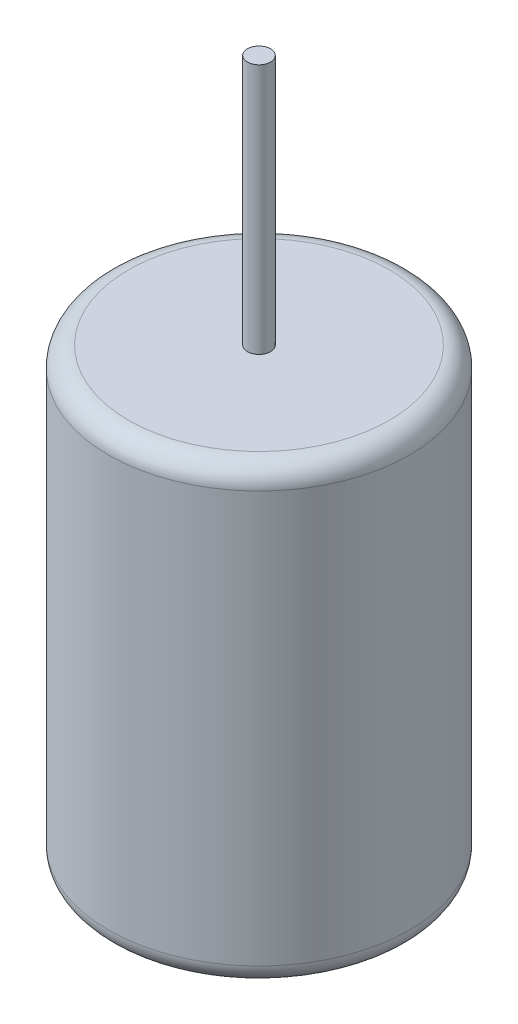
ISO-10303-21;
HEADER;
FILE_DESCRIPTION(('STEP AP214'),'2;1');
FILE_NAME('part.step','',(''),(''),'','','');
FILE_SCHEMA(('AUTOMOTIVE_DESIGN { 1 0 10303 214 1 1 1 1 }'));
ENDSEC;
DATA;
#1=APPLICATION_CONTEXT('core data for automotive mechanical design processes');
#2=APPLICATION_PROTOCOL_DEFINITION('international standard','automotive_design',2000,#1);
#3=PRODUCT_CONTEXT('',#1,'mechanical');
#4=PRODUCT('Part','Part','',(#3));
#5=PRODUCT_RELATED_PRODUCT_CATEGORY('part','',(#4));
#6=PRODUCT_DEFINITION_FORMATION('','',#4);
#7=PRODUCT_DEFINITION_CONTEXT('part definition',#1,'design');
#8=PRODUCT_DEFINITION('design','',#6,#7);
#9=PRODUCT_DEFINITION_SHAPE('','',#8);
#10=(LENGTH_UNIT() NAMED_UNIT(*) SI_UNIT(.MILLI.,.METRE.));
#11=(NAMED_UNIT(*) PLANE_ANGLE_UNIT() SI_UNIT($,.RADIAN.));
#12=(NAMED_UNIT(*) SI_UNIT($,.STERADIAN.) SOLID_ANGLE_UNIT());
#13=UNCERTAINTY_MEASURE_WITH_UNIT(LENGTH_MEASURE(1.E-05),#10,'distance_accuracy_value','');
#14=(GEOMETRIC_REPRESENTATION_CONTEXT(3) GLOBAL_UNCERTAINTY_ASSIGNED_CONTEXT((#13)) GLOBAL_UNIT_ASSIGNED_CONTEXT((#10,
#11,#12)) REPRESENTATION_CONTEXT('',''));
#15=CARTESIAN_POINT('',(0.,0.,0.));
#16=DIRECTION('',(0.,0.,1.));
#17=DIRECTION('',(1.,0.,0.));
#18=AXIS2_PLACEMENT_3D('',#15,#16,#17);
#19=CARTESIAN_POINT('',(0.,45.,0.));
#20=DIRECTION('',(0.,-1.,0.));
#21=DIRECTION('',(0.,0.,-1.));
#22=AXIS2_PLACEMENT_3D('',#19,#20,#21);
#23=CYLINDRICAL_SURFACE('',#22,15.);
#24=CARTESIAN_POINT('',(0.,2.,0.));
#25=DIRECTION('',(0.,1.,0.));
#26=DIRECTION('',(0.,0.,1.));
#27=AXIS2_PLACEMENT_3D('',#24,#25,#26);
#28=CIRCLE('',#27,15.);
#29=CARTESIAN_POINT('',(0.,1.99999999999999,-15.));
#30=VERTEX_POINT('',#29);
#31=EDGE_CURVE('E56',#30,#30,#28,.T.);
#32=CARTESIAN_POINT('',(0.,43.,0.));
#33=DIRECTION('',(0.,1.,0.));
#34=DIRECTION('',(0.,0.,1.));
#35=AXIS2_PLACEMENT_3D('',#32,#33,#34);
#36=CIRCLE('',#35,15.);
#37=CARTESIAN_POINT('',(0.,43.,-15.));
#38=VERTEX_POINT('',#37);
#39=EDGE_CURVE('E61',#38,#38,#36,.F.);
#40=CARTESIAN_POINT('',(0.,1.99999999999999,-15.));
#41=CARTESIAN_POINT('',(0.,2.42708333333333,-15.));
#42=CARTESIAN_POINT('',(0.,2.85416666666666,-15.));
#43=CARTESIAN_POINT('',(0.,3.70833333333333,-15.));
#44=CARTESIAN_POINT('',(0.,4.13541666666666,-15.));
#45=CARTESIAN_POINT('',(0.,4.98958333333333,-15.));
#46=CARTESIAN_POINT('',(0.,5.41666666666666,-15.));
#47=CARTESIAN_POINT('',(0.,6.27083333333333,-15.));
#48=CARTESIAN_POINT('',(0.,6.69791666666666,-15.));
#49=CARTESIAN_POINT('',(0.,7.55208333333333,-15.));
#50=CARTESIAN_POINT('',(0.,7.97916666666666,-15.));
#51=CARTESIAN_POINT('',(0.,8.83333333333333,-15.));
#52=CARTESIAN_POINT('',(0.,9.26041666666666,-15.));
#53=CARTESIAN_POINT('',(0.,10.1145833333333,-15.));
#54=CARTESIAN_POINT('',(0.,10.5416666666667,-15.));
#55=CARTESIAN_POINT('',(0.,11.3958333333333,-15.));
#56=CARTESIAN_POINT('',(0.,11.8229166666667,-15.));
#57=CARTESIAN_POINT('',(0.,12.6770833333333,-15.));
#58=CARTESIAN_POINT('',(0.,13.1041666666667,-15.));
#59=CARTESIAN_POINT('',(0.,13.9583333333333,-15.));
#60=CARTESIAN_POINT('',(0.,14.3854166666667,-15.));
#61=CARTESIAN_POINT('',(0.,15.2395833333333,-15.));
#62=CARTESIAN_POINT('',(0.,15.6666666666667,-15.));
#63=CARTESIAN_POINT('',(0.,16.5208333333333,-15.));
#64=CARTESIAN_POINT('',(0.,16.9479166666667,-15.));
#65=CARTESIAN_POINT('',(0.,17.8020833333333,-15.));
#66=CARTESIAN_POINT('',(0.,18.2291666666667,-15.));
#67=CARTESIAN_POINT('',(0.,19.0833333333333,-15.));
#68=CARTESIAN_POINT('',(0.,19.5104166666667,-15.));
#69=CARTESIAN_POINT('',(0.,20.3645833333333,-15.));
#70=CARTESIAN_POINT('',(0.,20.7916666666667,-15.));
#71=CARTESIAN_POINT('',(0.,21.6458333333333,-15.));
#72=CARTESIAN_POINT('',(0.,22.0729166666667,-15.));
#73=CARTESIAN_POINT('',(0.,22.9270833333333,-15.));
#74=CARTESIAN_POINT('',(0.,23.3541666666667,-15.));
#75=CARTESIAN_POINT('',(0.,24.2083333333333,-15.));
#76=CARTESIAN_POINT('',(0.,24.6354166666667,-15.));
#77=CARTESIAN_POINT('',(0.,25.4895833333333,-15.));
#78=CARTESIAN_POINT('',(0.,25.9166666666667,-15.));
#79=CARTESIAN_POINT('',(0.,26.7708333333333,-15.));
#80=CARTESIAN_POINT('',(0.,27.1979166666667,-15.));
#81=CARTESIAN_POINT('',(0.,28.0520833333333,-15.));
#82=CARTESIAN_POINT('',(0.,28.4791666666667,-15.));
#83=CARTESIAN_POINT('',(0.,29.3333333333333,-15.));
#84=CARTESIAN_POINT('',(0.,29.7604166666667,-15.));
#85=CARTESIAN_POINT('',(0.,30.6145833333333,-15.));
#86=CARTESIAN_POINT('',(0.,31.0416666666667,-15.));
#87=CARTESIAN_POINT('',(0.,31.8958333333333,-15.));
#88=CARTESIAN_POINT('',(0.,32.3229166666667,-15.));
#89=CARTESIAN_POINT('',(0.,33.1770833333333,-15.));
#90=CARTESIAN_POINT('',(0.,33.6041666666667,-15.));
#91=CARTESIAN_POINT('',(0.,34.4583333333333,-15.));
#92=CARTESIAN_POINT('',(0.,34.8854166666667,-15.));
#93=CARTESIAN_POINT('',(0.,35.7395833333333,-15.));
#94=CARTESIAN_POINT('',(0.,36.1666666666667,-15.));
#95=CARTESIAN_POINT('',(0.,37.0208333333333,-15.));
#96=CARTESIAN_POINT('',(0.,37.4479166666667,-15.));
#97=CARTESIAN_POINT('',(0.,38.3020833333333,-15.));
#98=CARTESIAN_POINT('',(0.,38.7291666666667,-15.));
#99=CARTESIAN_POINT('',(0.,39.5833333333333,-15.));
#100=CARTESIAN_POINT('',(0.,40.0104166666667,-15.));
#101=CARTESIAN_POINT('',(0.,40.8645833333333,-15.));
#102=CARTESIAN_POINT('',(0.,41.2916666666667,-15.));
#103=CARTESIAN_POINT('',(0.,42.1458333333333,-15.));
#104=CARTESIAN_POINT('',(0.,42.5729166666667,-15.));
#105=CARTESIAN_POINT('',(0.,43.,-15.));
#106=B_SPLINE_CURVE_WITH_KNOTS('',3,(#40,#41,#42,#43,#44,#45,#46,#47,#48,#49,#50,#51,#52,#53,
#54,#55,#56,#57,#58,#59,#60,#61,#62,#63,#64,#65,#66,#67,#68,#69,#70,#71,#72,#73,#74,#75,#76,#77,
#78,#79,#80,#81,#82,#83,#84,#85,#86,#87,#88,#89,#90,#91,#92,#93,#94,#95,#96,#97,#98,#99,#100,
#101,#102,#103,#104,#105),.UNSPECIFIED.,.F.,.F.,(4,2,2,2,2,2,2,2,2,2,2,2,2,2,2,2,2,2,2,2,2,2,2,
2,2,2,2,2,2,2,2,2,4),(0.,1.28125,2.5625,3.84375,5.125,6.40625,7.6875,8.96875,10.25,11.53125,
12.8125,14.09375,15.375,16.65625,17.9375,19.21875,20.5,21.78125,23.0625,24.34375,25.625,
26.90625,28.1875,29.46875,30.75,32.03125,33.3125,34.59375,35.875,37.15625,38.4375,39.71875,41.),.UNSPECIFIED.);
#107=EDGE_CURVE('BSEAM43',#30,#38,#106,.T.);
#108=ORIENTED_EDGE('',*,*,#31,.T.);
#109=ORIENTED_EDGE('',*,*,#39,.T.);
#110=ORIENTED_EDGE('',*,*,#107,.T.);
#111=ORIENTED_EDGE('',*,*,#107,.F.);
#112=EDGE_LOOP('',(#108,#110,#109,#111));
#113=FACE_BOUND('',#112,.T.);
#114=ADVANCED_FACE('F43',(#113),#23,.T.);
#115=CARTESIAN_POINT('',(0.,45.,0.));
#116=DIRECTION('',(0.,1.,0.));
#117=DIRECTION('',(0.,0.,1.));
#118=AXIS2_PLACEMENT_3D('',#115,#116,#117);
#119=PLANE('',#118);
#120=CARTESIAN_POINT('',(0.,45.,0.));
#121=DIRECTION('',(0.,1.,0.));
#122=DIRECTION('',(0.,0.,1.));
#123=AXIS2_PLACEMENT_3D('',#120,#121,#122);
#124=CIRCLE('',#123,1.15);
#125=CARTESIAN_POINT('',(0.,45.,1.15));
#126=VERTEX_POINT('',#125);
#127=EDGE_CURVE('E68',#126,#126,#124,.T.);
#128=ORIENTED_EDGE('',*,*,#127,.F.);
#129=EDGE_LOOP('',(#128));
#130=FACE_BOUND('',#129,.T.);
#131=CARTESIAN_POINT('',(0.,45.,0.));
#132=DIRECTION('',(0.,1.,0.));
#133=DIRECTION('',(0.,0.,1.));
#134=AXIS2_PLACEMENT_3D('',#131,#132,#133);
#135=CIRCLE('',#134,13.);
#136=CARTESIAN_POINT('',(0.,45.,13.));
#137=VERTEX_POINT('',#136);
#138=EDGE_CURVE('E10',#137,#137,#135,.T.);
#139=ORIENTED_EDGE('',*,*,#138,.T.);
#140=EDGE_LOOP('',(#139));
#141=FACE_BOUND('',#140,.T.);
#142=ADVANCED_FACE('F84',(#130,#141),#119,.T.);
#143=CARTESIAN_POINT('',(0.,0.,0.));
#144=DIRECTION('',(0.,1.,0.));
#145=DIRECTION('',(0.,0.,1.));
#146=AXIS2_PLACEMENT_3D('',#143,#144,#145);
#147=PLANE('',#146);
#148=CARTESIAN_POINT('',(0.,0.,0.));
#149=DIRECTION('',(0.,1.,0.));
#150=DIRECTION('',(0.,0.,1.));
#151=AXIS2_PLACEMENT_3D('',#148,#149,#150);
#152=CIRCLE('',#151,13.);
#153=CARTESIAN_POINT('',(0.,0.,13.));
#154=VERTEX_POINT('',#153);
#155=EDGE_CURVE('E51',#154,#154,#152,.F.);
#156=ORIENTED_EDGE('',*,*,#155,.T.);
#157=EDGE_LOOP('',(#156));
#158=FACE_BOUND('',#157,.T.);
#159=ADVANCED_FACE('F86',(#158),#147,.F.);
#160=CARTESIAN_POINT('',(0.,2.,0.));
#161=DIRECTION('',(0.,1.,0.));
#162=DIRECTION('',(0.,0.,1.));
#163=AXIS2_PLACEMENT_3D('',#160,#161,#162);
#164=TOROIDAL_SURFACE('',#163,13.,2.);
#165=ORIENTED_EDGE('',*,*,#155,.F.);
#166=EDGE_LOOP('',(#165));
#167=FACE_BOUND('',#166,.T.);
#168=ORIENTED_EDGE('',*,*,#31,.F.);
#169=EDGE_LOOP('',(#168));
#170=FACE_BOUND('',#169,.T.);
#171=ADVANCED_FACE('F92',(#167,#170),#164,.T.);
#172=CARTESIAN_POINT('',(0.,43.,0.));
#173=DIRECTION('',(0.,1.,0.));
#174=DIRECTION('',(0.,0.,1.));
#175=AXIS2_PLACEMENT_3D('',#172,#173,#174);
#176=TOROIDAL_SURFACE('',#175,13.,2.);
#177=ORIENTED_EDGE('',*,*,#39,.F.);
#178=EDGE_LOOP('',(#177));
#179=FACE_BOUND('',#178,.T.);
#180=ORIENTED_EDGE('',*,*,#138,.F.);
#181=EDGE_LOOP('',(#180));
#182=FACE_BOUND('',#181,.T.);
#183=ADVANCED_FACE('F45',(#179,#182),#176,.T.);
#184=CARTESIAN_POINT('',(0.,70.,0.));
#185=DIRECTION('',(0.,-1.,0.));
#186=DIRECTION('',(0.,0.,-1.));
#187=AXIS2_PLACEMENT_3D('',#184,#185,#186);
#188=CYLINDRICAL_SURFACE('',#187,1.15);
#189=CARTESIAN_POINT('',(0.,70.,0.));
#190=DIRECTION('',(0.,1.,0.));
#191=DIRECTION('',(0.,0.,1.));
#192=AXIS2_PLACEMENT_3D('',#189,#190,#191);
#193=CIRCLE('',#192,1.15);
#194=CARTESIAN_POINT('',(0.,70.,1.15));
#195=VERTEX_POINT('',#194);
#196=EDGE_CURVE('E67',#195,#195,#193,.T.);
#197=ORIENTED_EDGE('',*,*,#196,.F.);
#198=EDGE_LOOP('',(#197));
#199=FACE_BOUND('',#198,.T.);
#200=ORIENTED_EDGE('',*,*,#127,.T.);
#201=EDGE_LOOP('',(#200));
#202=FACE_BOUND('',#201,.T.);
#203=ADVANCED_FACE('F78',(#199,#202),#188,.T.);
#204=CARTESIAN_POINT('',(0.,70.,0.));
#205=DIRECTION('',(0.,1.,0.));
#206=DIRECTION('',(0.,0.,1.));
#207=AXIS2_PLACEMENT_3D('',#204,#205,#206);
#208=PLANE('',#207);
#209=ORIENTED_EDGE('',*,*,#196,.T.);
#210=EDGE_LOOP('',(#209));
#211=FACE_BOUND('',#210,.T.);
#212=ADVANCED_FACE('F76',(#211),#208,.T.);
#213=CLOSED_SHELL('',(#114,#142,#159,#171,#183,#203,#212));
#214=MANIFOLD_SOLID_BREP('B2',#213);
#215=ADVANCED_BREP_SHAPE_REPRESENTATION('',(#18,#214),#14);
#216=SHAPE_DEFINITION_REPRESENTATION(#9,#215);
ENDSEC;
END-ISO-10303-21;
